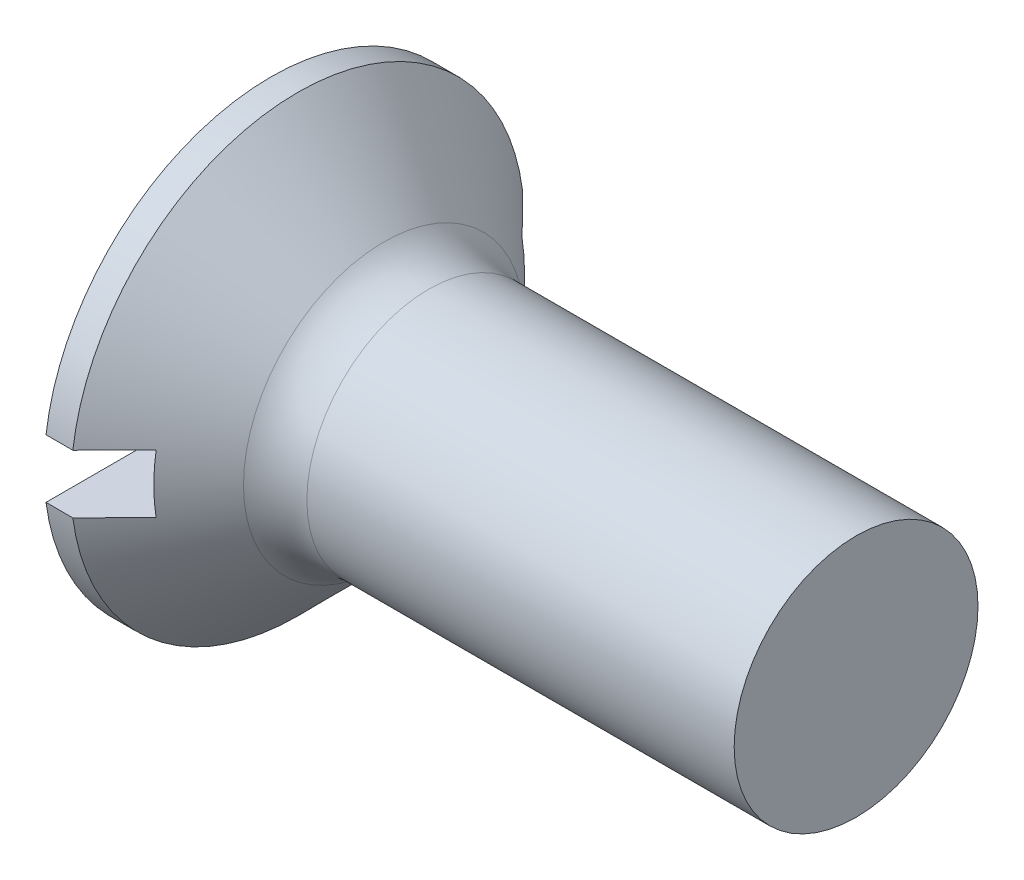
from build123d import *

# Parameters (mm, degrees)
FILLET1_R  = 1.3
SKETCH2_W  = 9.3
SKETCH2_H  = 1.2
SLOT_DEPTH = 1.4


with BuildPart() as part:
    # BodySke → Base-Revolve (revolve)
    with BuildSketch(Plane.XY, mode=Mode.PRIVATE) as base_revolve_sk:
        Polygon((0, 0), (0, 4.65), (0.55, 4.65), (2.7, 2.5), (12, 2.5), (12, 0), align=None)
    revolve(base_revolve_sk.sketch.rotate(Axis((-6.35, 0, 0), (1, 0, 0)), 90), axis=Axis((-6.35, 0, 0), (1, 0, 0)))

    # Fillet1
    fillet1_edges = [part.edges().sort_by_distance(p)[0] for p in [
        (2.7, 0, -2.5),
    ]]
    fillet(fillet1_edges, radius=FILLET1_R)

    # Sketch2 → Slot (cut)
    with BuildSketch(Plane.ZY):
        Rectangle(SKETCH2_W, SKETCH2_H)
    extrude(amount=-SLOT_DEPTH, mode=Mode.SUBTRACT)


solid = part.part
